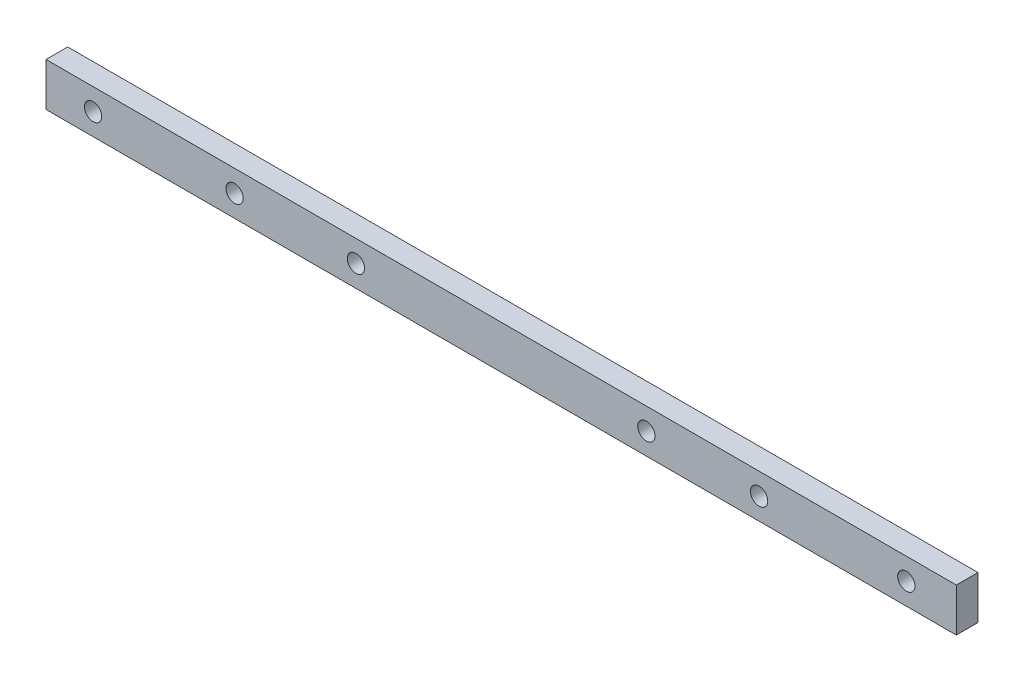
ISO-10303-21;
HEADER;
FILE_DESCRIPTION(('STEP AP214'),'2;1');
FILE_NAME('part.step','',(''),(''),'','','');
FILE_SCHEMA(('AUTOMOTIVE_DESIGN { 1 0 10303 214 1 1 1 1 }'));
ENDSEC;
DATA;
#1=APPLICATION_CONTEXT('core data for automotive mechanical design processes');
#2=APPLICATION_PROTOCOL_DEFINITION('international standard','automotive_design',2000,#1);
#3=PRODUCT_CONTEXT('',#1,'mechanical');
#4=PRODUCT('Part','Part','',(#3));
#5=PRODUCT_RELATED_PRODUCT_CATEGORY('part','',(#4));
#6=PRODUCT_DEFINITION_FORMATION('','',#4);
#7=PRODUCT_DEFINITION_CONTEXT('part definition',#1,'design');
#8=PRODUCT_DEFINITION('design','',#6,#7);
#9=PRODUCT_DEFINITION_SHAPE('','',#8);
#10=(LENGTH_UNIT() NAMED_UNIT(*) SI_UNIT(.MILLI.,.METRE.));
#11=(NAMED_UNIT(*) PLANE_ANGLE_UNIT() SI_UNIT($,.RADIAN.));
#12=(NAMED_UNIT(*) SI_UNIT($,.STERADIAN.) SOLID_ANGLE_UNIT());
#13=UNCERTAINTY_MEASURE_WITH_UNIT(LENGTH_MEASURE(1.E-05),#10,'distance_accuracy_value','');
#14=(GEOMETRIC_REPRESENTATION_CONTEXT(3) GLOBAL_UNCERTAINTY_ASSIGNED_CONTEXT((#13)) GLOBAL_UNIT_ASSIGNED_CONTEXT((#10,
#11,#12)) REPRESENTATION_CONTEXT('',''));
#15=CARTESIAN_POINT('',(0.,0.,0.));
#16=DIRECTION('',(0.,0.,1.));
#17=DIRECTION('',(1.,0.,0.));
#18=AXIS2_PLACEMENT_3D('',#15,#16,#17);
#19=CARTESIAN_POINT('',(-105.,5.,5.));
#20=DIRECTION('',(1.,0.,0.));
#21=DIRECTION('',(0.,0.,-1.));
#22=AXIS2_PLACEMENT_3D('',#19,#20,#21);
#23=PLANE('',#22);
#24=DIRECTION('',(0.,-1.,0.));
#25=VECTOR('',#24,1.);
#26=CARTESIAN_POINT('',(-105.,5.,0.));
#27=LINE('',#26,#25);
#28=CARTESIAN_POINT('',(-105.,5.,0.));
#29=VERTEX_POINT('',#28);
#30=CARTESIAN_POINT('',(-105.,-5.,0.));
#31=VERTEX_POINT('',#30);
#32=EDGE_CURVE('E97',#29,#31,#27,.T.);
#33=ORIENTED_EDGE('',*,*,#32,.T.);
#34=DIRECTION('',(0.,0.,-1.));
#35=VECTOR('',#34,1.);
#36=CARTESIAN_POINT('',(-105.,-5.,5.));
#37=LINE('',#36,#35);
#38=CARTESIAN_POINT('',(-105.,-5.,5.));
#39=VERTEX_POINT('',#38);
#40=EDGE_CURVE('E11',#39,#31,#37,.T.);
#41=ORIENTED_EDGE('',*,*,#40,.F.);
#42=DIRECTION('',(0.,-1.,0.));
#43=VECTOR('',#42,1.);
#44=CARTESIAN_POINT('',(-105.,5.,5.));
#45=LINE('',#44,#43);
#46=CARTESIAN_POINT('',(-105.,5.,5.));
#47=VERTEX_POINT('',#46);
#48=EDGE_CURVE('E85',#47,#39,#45,.T.);
#49=ORIENTED_EDGE('',*,*,#48,.F.);
#50=DIRECTION('',(0.,0.,-1.));
#51=VECTOR('',#50,1.);
#52=CARTESIAN_POINT('',(-105.,5.,5.));
#53=LINE('',#52,#51);
#54=EDGE_CURVE('E93',#47,#29,#53,.T.);
#55=ORIENTED_EDGE('',*,*,#54,.T.);
#56=EDGE_LOOP('',(#33,#41,#49,#55));
#57=FACE_BOUND('',#56,.T.);
#58=ADVANCED_FACE('F34',(#57),#23,.F.);
#59=CARTESIAN_POINT('',(-105.,-5.,5.));
#60=DIRECTION('',(0.,1.,0.));
#61=DIRECTION('',(0.,0.,1.));
#62=AXIS2_PLACEMENT_3D('',#59,#60,#61);
#63=PLANE('',#62);
#64=DIRECTION('',(1.,0.,0.));
#65=VECTOR('',#64,1.);
#66=CARTESIAN_POINT('',(-105.,-5.,0.));
#67=LINE('',#66,#65);
#68=CARTESIAN_POINT('',(105.,-5.,0.));
#69=VERTEX_POINT('',#68);
#70=EDGE_CURVE('E89',#31,#69,#67,.T.);
#71=ORIENTED_EDGE('',*,*,#70,.T.);
#72=DIRECTION('',(0.,0.,-1.));
#73=VECTOR('',#72,1.);
#74=CARTESIAN_POINT('',(105.,-5.,5.));
#75=LINE('',#74,#73);
#76=CARTESIAN_POINT('',(105.,-5.,5.));
#77=VERTEX_POINT('',#76);
#78=EDGE_CURVE('E42',#77,#69,#75,.T.);
#79=ORIENTED_EDGE('',*,*,#78,.F.);
#80=DIRECTION('',(1.,0.,0.));
#81=VECTOR('',#80,1.);
#82=CARTESIAN_POINT('',(-105.,-5.,5.));
#83=LINE('',#82,#81);
#84=EDGE_CURVE('E80',#39,#77,#83,.T.);
#85=ORIENTED_EDGE('',*,*,#84,.F.);
#86=ORIENTED_EDGE('',*,*,#40,.T.);
#87=EDGE_LOOP('',(#71,#79,#85,#86));
#88=FACE_BOUND('',#87,.T.);
#89=ADVANCED_FACE('F88',(#88),#63,.F.);
#90=CARTESIAN_POINT('',(105.,5.,5.));
#91=DIRECTION('',(-1.,0.,0.));
#92=DIRECTION('',(0.,0.,1.));
#93=AXIS2_PLACEMENT_3D('',#90,#91,#92);
#94=PLANE('',#93);
#95=DIRECTION('',(0.,1.,0.));
#96=VECTOR('',#95,1.);
#97=CARTESIAN_POINT('',(105.,5.,0.));
#98=LINE('',#97,#96);
#99=CARTESIAN_POINT('',(105.,5.,0.));
#100=VERTEX_POINT('',#99);
#101=EDGE_CURVE('E67',#69,#100,#98,.T.);
#102=ORIENTED_EDGE('',*,*,#101,.T.);
#103=DIRECTION('',(0.,0.,-1.));
#104=VECTOR('',#103,1.);
#105=CARTESIAN_POINT('',(105.,5.,5.));
#106=LINE('',#105,#104);
#107=CARTESIAN_POINT('',(105.,5.,5.));
#108=VERTEX_POINT('',#107);
#109=EDGE_CURVE('E90',#108,#100,#106,.T.);
#110=ORIENTED_EDGE('',*,*,#109,.F.);
#111=DIRECTION('',(0.,1.,0.));
#112=VECTOR('',#111,1.);
#113=CARTESIAN_POINT('',(105.,5.,5.));
#114=LINE('',#113,#112);
#115=EDGE_CURVE('E83',#77,#108,#114,.T.);
#116=ORIENTED_EDGE('',*,*,#115,.F.);
#117=ORIENTED_EDGE('',*,*,#78,.T.);
#118=EDGE_LOOP('',(#102,#110,#116,#117));
#119=FACE_BOUND('',#118,.T.);
#120=ADVANCED_FACE('F91',(#119),#94,.F.);
#121=CARTESIAN_POINT('',(-105.,5.,5.));
#122=DIRECTION('',(0.,-1.,0.));
#123=DIRECTION('',(0.,0.,-1.));
#124=AXIS2_PLACEMENT_3D('',#121,#122,#123);
#125=PLANE('',#124);
#126=DIRECTION('',(-1.,0.,0.));
#127=VECTOR('',#126,1.);
#128=CARTESIAN_POINT('',(-105.,5.,0.));
#129=LINE('',#128,#127);
#130=EDGE_CURVE('E73',#100,#29,#129,.T.);
#131=ORIENTED_EDGE('',*,*,#130,.T.);
#132=ORIENTED_EDGE('',*,*,#54,.F.);
#133=DIRECTION('',(-1.,0.,0.));
#134=VECTOR('',#133,1.);
#135=CARTESIAN_POINT('',(-105.,5.,5.));
#136=LINE('',#135,#134);
#137=EDGE_CURVE('E50',#108,#47,#136,.T.);
#138=ORIENTED_EDGE('',*,*,#137,.F.);
#139=ORIENTED_EDGE('',*,*,#109,.T.);
#140=EDGE_LOOP('',(#131,#132,#138,#139));
#141=FACE_BOUND('',#140,.T.);
#142=ADVANCED_FACE('F105',(#141),#125,.F.);
#143=CARTESIAN_POINT('',(0.,0.,5.));
#144=DIRECTION('',(0.,0.,1.));
#145=DIRECTION('',(1.,0.,0.));
#146=AXIS2_PLACEMENT_3D('',#143,#144,#145);
#147=PLANE('',#146);
#148=CARTESIAN_POINT('',(-94.1387178,0.,5.));
#149=DIRECTION('',(0.,0.,1.));
#150=DIRECTION('',(1.,0.,0.));
#151=AXIS2_PLACEMENT_3D('',#148,#149,#150);
#152=CIRCLE('',#151,2.);
#153=CARTESIAN_POINT('',(-92.1387178,0.,5.));
#154=VERTEX_POINT('',#153);
#155=EDGE_CURVE('E141',#154,#154,#152,.T.);
#156=ORIENTED_EDGE('',*,*,#155,.F.);
#157=EDGE_LOOP('',(#156));
#158=FACE_BOUND('',#157,.T.);
#159=CARTESIAN_POINT('',(-61.5,0.,5.));
#160=DIRECTION('',(0.,0.,1.));
#161=DIRECTION('',(1.,0.,0.));
#162=AXIS2_PLACEMENT_3D('',#159,#160,#161);
#163=CIRCLE('',#162,2.);
#164=CARTESIAN_POINT('',(-59.5,0.,5.));
#165=VERTEX_POINT('',#164);
#166=EDGE_CURVE('E135',#165,#165,#163,.T.);
#167=ORIENTED_EDGE('',*,*,#166,.F.);
#168=EDGE_LOOP('',(#167));
#169=FACE_BOUND('',#168,.T.);
#170=CARTESIAN_POINT('',(-33.5,0.,5.));
#171=DIRECTION('',(0.,0.,1.));
#172=DIRECTION('',(1.,0.,0.));
#173=AXIS2_PLACEMENT_3D('',#170,#171,#172);
#174=CIRCLE('',#173,2.);
#175=CARTESIAN_POINT('',(-31.5,0.,5.));
#176=VERTEX_POINT('',#175);
#177=EDGE_CURVE('E129',#176,#176,#174,.T.);
#178=ORIENTED_EDGE('',*,*,#177,.F.);
#179=EDGE_LOOP('',(#178));
#180=FACE_BOUND('',#179,.T.);
#181=CARTESIAN_POINT('',(33.5,0.,5.));
#182=DIRECTION('',(0.,0.,1.));
#183=DIRECTION('',(1.,0.,0.));
#184=AXIS2_PLACEMENT_3D('',#181,#182,#183);
#185=CIRCLE('',#184,2.);
#186=CARTESIAN_POINT('',(35.5,0.,5.));
#187=VERTEX_POINT('',#186);
#188=EDGE_CURVE('E123',#187,#187,#185,.T.);
#189=ORIENTED_EDGE('',*,*,#188,.F.);
#190=EDGE_LOOP('',(#189));
#191=FACE_BOUND('',#190,.T.);
#192=CARTESIAN_POINT('',(93.468,0.,5.));
#193=DIRECTION('',(0.,0.,1.));
#194=DIRECTION('',(1.,0.,0.));
#195=AXIS2_PLACEMENT_3D('',#192,#193,#194);
#196=CIRCLE('',#195,2.);
#197=CARTESIAN_POINT('',(95.468,0.,5.));
#198=VERTEX_POINT('',#197);
#199=EDGE_CURVE('E117',#198,#198,#196,.T.);
#200=ORIENTED_EDGE('',*,*,#199,.F.);
#201=EDGE_LOOP('',(#200));
#202=FACE_BOUND('',#201,.T.);
#203=CARTESIAN_POINT('',(59.5,0.,5.));
#204=DIRECTION('',(0.,0.,1.));
#205=DIRECTION('',(1.,0.,0.));
#206=AXIS2_PLACEMENT_3D('',#203,#204,#205);
#207=CIRCLE('',#206,2.);
#208=CARTESIAN_POINT('',(61.5,0.,5.));
#209=VERTEX_POINT('',#208);
#210=EDGE_CURVE('E111',#209,#209,#207,.T.);
#211=ORIENTED_EDGE('',*,*,#210,.F.);
#212=EDGE_LOOP('',(#211));
#213=FACE_BOUND('',#212,.T.);
#214=ORIENTED_EDGE('',*,*,#48,.T.);
#215=ORIENTED_EDGE('',*,*,#84,.T.);
#216=ORIENTED_EDGE('',*,*,#115,.T.);
#217=ORIENTED_EDGE('',*,*,#137,.T.);
#218=EDGE_LOOP('',(#214,#215,#216,#217));
#219=FACE_BOUND('',#218,.T.);
#220=ADVANCED_FACE('F81',(#158,#169,#180,#191,#202,#213,#219),#147,.T.);
#221=CARTESIAN_POINT('',(0.,0.,0.));
#222=DIRECTION('',(0.,0.,1.));
#223=DIRECTION('',(1.,0.,0.));
#224=AXIS2_PLACEMENT_3D('',#221,#222,#223);
#225=PLANE('',#224);
#226=CARTESIAN_POINT('',(-94.1387178,0.,0.));
#227=DIRECTION('',(0.,0.,1.));
#228=DIRECTION('',(1.,0.,0.));
#229=AXIS2_PLACEMENT_3D('',#226,#227,#228);
#230=CIRCLE('',#229,2.);
#231=CARTESIAN_POINT('',(-92.1387178,0.,0.));
#232=VERTEX_POINT('',#231);
#233=EDGE_CURVE('E138',#232,#232,#230,.T.);
#234=ORIENTED_EDGE('',*,*,#233,.T.);
#235=EDGE_LOOP('',(#234));
#236=FACE_BOUND('',#235,.T.);
#237=CARTESIAN_POINT('',(-61.5,0.,0.));
#238=DIRECTION('',(0.,0.,1.));
#239=DIRECTION('',(1.,0.,0.));
#240=AXIS2_PLACEMENT_3D('',#237,#238,#239);
#241=CIRCLE('',#240,2.);
#242=CARTESIAN_POINT('',(-59.5,0.,0.));
#243=VERTEX_POINT('',#242);
#244=EDGE_CURVE('E132',#243,#243,#241,.T.);
#245=ORIENTED_EDGE('',*,*,#244,.T.);
#246=EDGE_LOOP('',(#245));
#247=FACE_BOUND('',#246,.T.);
#248=CARTESIAN_POINT('',(-33.5,0.,0.));
#249=DIRECTION('',(0.,0.,1.));
#250=DIRECTION('',(1.,0.,0.));
#251=AXIS2_PLACEMENT_3D('',#248,#249,#250);
#252=CIRCLE('',#251,2.);
#253=CARTESIAN_POINT('',(-31.5,0.,0.));
#254=VERTEX_POINT('',#253);
#255=EDGE_CURVE('E126',#254,#254,#252,.T.);
#256=ORIENTED_EDGE('',*,*,#255,.T.);
#257=EDGE_LOOP('',(#256));
#258=FACE_BOUND('',#257,.T.);
#259=CARTESIAN_POINT('',(33.5,0.,0.));
#260=DIRECTION('',(0.,0.,1.));
#261=DIRECTION('',(1.,0.,0.));
#262=AXIS2_PLACEMENT_3D('',#259,#260,#261);
#263=CIRCLE('',#262,2.);
#264=CARTESIAN_POINT('',(35.5,0.,0.));
#265=VERTEX_POINT('',#264);
#266=EDGE_CURVE('E120',#265,#265,#263,.T.);
#267=ORIENTED_EDGE('',*,*,#266,.T.);
#268=EDGE_LOOP('',(#267));
#269=FACE_BOUND('',#268,.T.);
#270=CARTESIAN_POINT('',(93.468,0.,0.));
#271=DIRECTION('',(0.,0.,1.));
#272=DIRECTION('',(1.,0.,0.));
#273=AXIS2_PLACEMENT_3D('',#270,#271,#272);
#274=CIRCLE('',#273,2.);
#275=CARTESIAN_POINT('',(95.468,0.,0.));
#276=VERTEX_POINT('',#275);
#277=EDGE_CURVE('E114',#276,#276,#274,.T.);
#278=ORIENTED_EDGE('',*,*,#277,.T.);
#279=EDGE_LOOP('',(#278));
#280=FACE_BOUND('',#279,.T.);
#281=CARTESIAN_POINT('',(59.5,0.,0.));
#282=DIRECTION('',(0.,0.,1.));
#283=DIRECTION('',(1.,0.,0.));
#284=AXIS2_PLACEMENT_3D('',#281,#282,#283);
#285=CIRCLE('',#284,2.);
#286=CARTESIAN_POINT('',(61.5,0.,0.));
#287=VERTEX_POINT('',#286);
#288=EDGE_CURVE('E100',#287,#287,#285,.T.);
#289=ORIENTED_EDGE('',*,*,#288,.T.);
#290=EDGE_LOOP('',(#289));
#291=FACE_BOUND('',#290,.T.);
#292=ORIENTED_EDGE('',*,*,#32,.F.);
#293=ORIENTED_EDGE('',*,*,#130,.F.);
#294=ORIENTED_EDGE('',*,*,#101,.F.);
#295=ORIENTED_EDGE('',*,*,#70,.F.);
#296=EDGE_LOOP('',(#292,#293,#294,#295));
#297=FACE_BOUND('',#296,.T.);
#298=ADVANCED_FACE('F108',(#236,#247,#258,#269,#280,#291,#297),#225,.F.);
#299=CARTESIAN_POINT('',(59.5,0.,0.));
#300=DIRECTION('',(0.,0.,1.));
#301=DIRECTION('',(1.,0.,0.));
#302=AXIS2_PLACEMENT_3D('',#299,#300,#301);
#303=CYLINDRICAL_SURFACE('',#302,2.);
#304=ORIENTED_EDGE('',*,*,#288,.F.);
#305=EDGE_LOOP('',(#304));
#306=FACE_BOUND('',#305,.T.);
#307=ORIENTED_EDGE('',*,*,#210,.T.);
#308=EDGE_LOOP('',(#307));
#309=FACE_BOUND('',#308,.T.);
#310=ADVANCED_FACE('F169',(#306,#309),#303,.F.);
#311=CARTESIAN_POINT('',(93.468,0.,0.));
#312=DIRECTION('',(0.,0.,1.));
#313=DIRECTION('',(1.,0.,0.));
#314=AXIS2_PLACEMENT_3D('',#311,#312,#313);
#315=CYLINDRICAL_SURFACE('',#314,2.);
#316=ORIENTED_EDGE('',*,*,#277,.F.);
#317=EDGE_LOOP('',(#316));
#318=FACE_BOUND('',#317,.T.);
#319=ORIENTED_EDGE('',*,*,#199,.T.);
#320=EDGE_LOOP('',(#319));
#321=FACE_BOUND('',#320,.T.);
#322=ADVANCED_FACE('F171',(#318,#321),#315,.F.);
#323=CARTESIAN_POINT('',(33.5,0.,0.));
#324=DIRECTION('',(0.,0.,1.));
#325=DIRECTION('',(1.,0.,0.));
#326=AXIS2_PLACEMENT_3D('',#323,#324,#325);
#327=CYLINDRICAL_SURFACE('',#326,2.);
#328=ORIENTED_EDGE('',*,*,#266,.F.);
#329=EDGE_LOOP('',(#328));
#330=FACE_BOUND('',#329,.T.);
#331=ORIENTED_EDGE('',*,*,#188,.T.);
#332=EDGE_LOOP('',(#331));
#333=FACE_BOUND('',#332,.T.);
#334=ADVANCED_FACE('F178',(#330,#333),#327,.F.);
#335=CARTESIAN_POINT('',(-33.5,0.,0.));
#336=DIRECTION('',(0.,0.,1.));
#337=DIRECTION('',(1.,0.,0.));
#338=AXIS2_PLACEMENT_3D('',#335,#336,#337);
#339=CYLINDRICAL_SURFACE('',#338,2.);
#340=ORIENTED_EDGE('',*,*,#255,.F.);
#341=EDGE_LOOP('',(#340));
#342=FACE_BOUND('',#341,.T.);
#343=ORIENTED_EDGE('',*,*,#177,.T.);
#344=EDGE_LOOP('',(#343));
#345=FACE_BOUND('',#344,.T.);
#346=ADVANCED_FACE('F224',(#342,#345),#339,.F.);
#347=CARTESIAN_POINT('',(-61.5,0.,0.));
#348=DIRECTION('',(0.,0.,1.));
#349=DIRECTION('',(1.,0.,0.));
#350=AXIS2_PLACEMENT_3D('',#347,#348,#349);
#351=CYLINDRICAL_SURFACE('',#350,2.);
#352=ORIENTED_EDGE('',*,*,#244,.F.);
#353=EDGE_LOOP('',(#352));
#354=FACE_BOUND('',#353,.T.);
#355=ORIENTED_EDGE('',*,*,#166,.T.);
#356=EDGE_LOOP('',(#355));
#357=FACE_BOUND('',#356,.T.);
#358=ADVANCED_FACE('F152',(#354,#357),#351,.F.);
#359=CARTESIAN_POINT('',(-94.1387178,0.,0.));
#360=DIRECTION('',(0.,0.,1.));
#361=DIRECTION('',(1.,0.,0.));
#362=AXIS2_PLACEMENT_3D('',#359,#360,#361);
#363=CYLINDRICAL_SURFACE('',#362,2.);
#364=ORIENTED_EDGE('',*,*,#233,.F.);
#365=EDGE_LOOP('',(#364));
#366=FACE_BOUND('',#365,.T.);
#367=ORIENTED_EDGE('',*,*,#155,.T.);
#368=EDGE_LOOP('',(#367));
#369=FACE_BOUND('',#368,.T.);
#370=ADVANCED_FACE('F149',(#366,#369),#363,.F.);
#371=CLOSED_SHELL('',(#58,#89,#120,#142,#220,#298,#310,#322,#334,#346,#358,#370));
#372=MANIFOLD_SOLID_BREP('B2',#371);
#373=ADVANCED_BREP_SHAPE_REPRESENTATION('',(#18,#372),#14);
#374=SHAPE_DEFINITION_REPRESENTATION(#9,#373);
ENDSEC;
END-ISO-10303-21;
